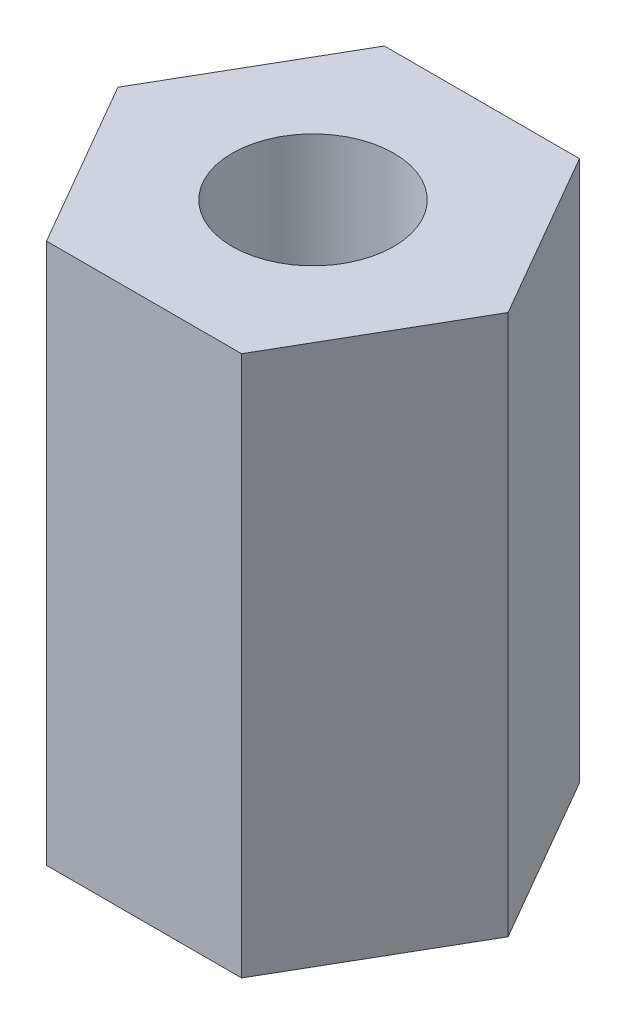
from build123d import *

# Parameters (mm, degrees)
BOSS_EXTRUDE1_DEPTH   = 12.7
F_6_CLEARANCE_HOLE1_D = 3.7973


with BuildPart() as part:
    # Sketch1 → Boss-Extrude1 (new body)
    with BuildSketch(Plane(origin=(0, 0, 0), x_dir=(1, 0, 0), z_dir=(0, 1, 0))):
        Polygon((-2.291358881, 3.96875), (2.291358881, 3.96875), (4.582717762, 0), (2.291358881, -3.96875), (-2.291358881, -3.96875), (-4.582717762, 0), align=None)
    extrude(amount=BOSS_EXTRUDE1_DEPTH)

    # 6 Clearance Hole1 (through all)
    with Locations(Plane(origin=(0, 12.7, 0), x_dir=(1, 0, 0), z_dir=(0, 1, 0))):
        with Locations((0, 0)):
            Hole(F_6_CLEARANCE_HOLE1_D / 2)


solid = part.part
